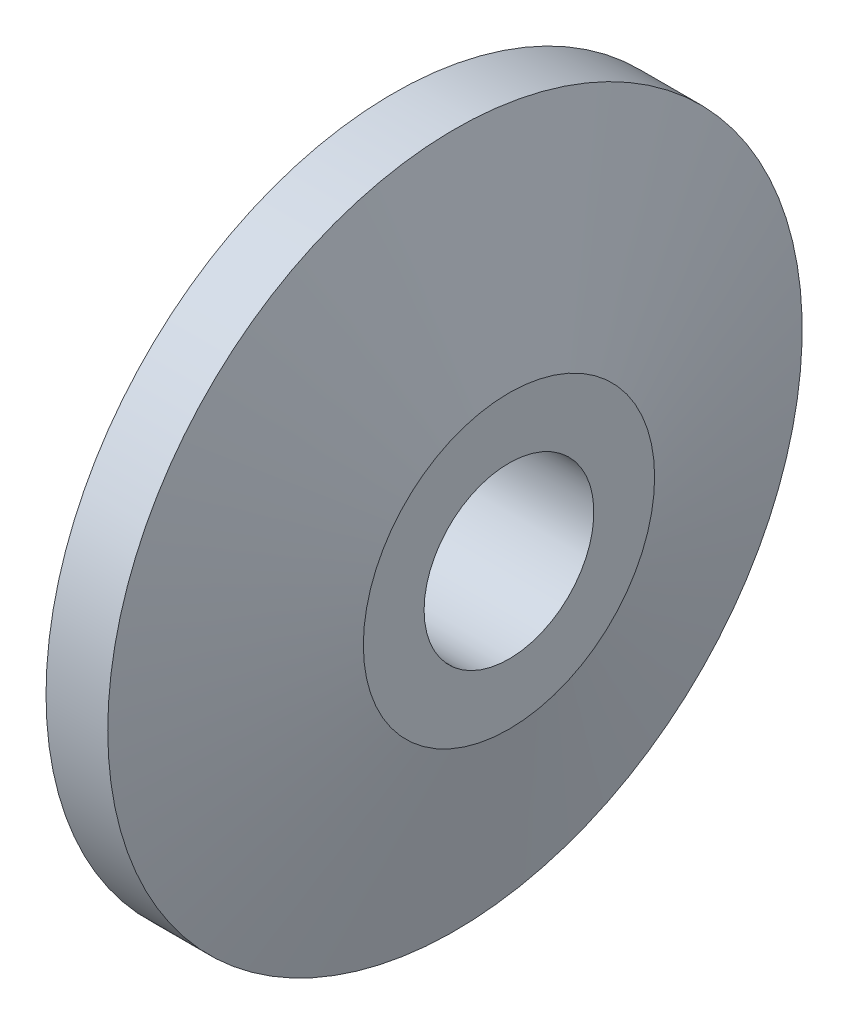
ISO-10303-21;
HEADER;
FILE_DESCRIPTION(('STEP AP214'),'2;1');
FILE_NAME('part.step','',(''),(''),'','','');
FILE_SCHEMA(('AUTOMOTIVE_DESIGN { 1 0 10303 214 1 1 1 1 }'));
ENDSEC;
DATA;
#1=APPLICATION_CONTEXT('core data for automotive mechanical design processes');
#2=APPLICATION_PROTOCOL_DEFINITION('international standard','automotive_design',2000,#1);
#3=PRODUCT_CONTEXT('',#1,'mechanical');
#4=PRODUCT('Part','Part','',(#3));
#5=PRODUCT_RELATED_PRODUCT_CATEGORY('part','',(#4));
#6=PRODUCT_DEFINITION_FORMATION('','',#4);
#7=PRODUCT_DEFINITION_CONTEXT('part definition',#1,'design');
#8=PRODUCT_DEFINITION('design','',#6,#7);
#9=PRODUCT_DEFINITION_SHAPE('','',#8);
#10=(LENGTH_UNIT() NAMED_UNIT(*) SI_UNIT(.MILLI.,.METRE.));
#11=(NAMED_UNIT(*) PLANE_ANGLE_UNIT() SI_UNIT($,.RADIAN.));
#12=(NAMED_UNIT(*) SI_UNIT($,.STERADIAN.) SOLID_ANGLE_UNIT());
#13=UNCERTAINTY_MEASURE_WITH_UNIT(LENGTH_MEASURE(1.E-05),#10,'distance_accuracy_value','');
#14=(GEOMETRIC_REPRESENTATION_CONTEXT(3) GLOBAL_UNCERTAINTY_ASSIGNED_CONTEXT((#13)) GLOBAL_UNIT_ASSIGNED_CONTEXT((#10,
#11,#12)) REPRESENTATION_CONTEXT('',''));
#15=CARTESIAN_POINT('',(0.,0.,0.));
#16=DIRECTION('',(0.,0.,1.));
#17=DIRECTION('',(1.,0.,0.));
#18=AXIS2_PLACEMENT_3D('',#15,#16,#17);
#19=CARTESIAN_POINT('',(0.,25.,0.));
#20=DIRECTION('',(1.,0.,0.));
#21=DIRECTION('',(0.,0.,-1.));
#22=AXIS2_PLACEMENT_3D('',#19,#20,#21);
#23=PLANE('',#22);
#24=CARTESIAN_POINT('',(0.,0.,0.));
#25=DIRECTION('',(-1.,0.,0.));
#26=DIRECTION('',(0.,0.,1.));
#27=AXIS2_PLACEMENT_3D('',#24,#25,#26);
#28=CIRCLE('',#27,11.);
#29=CARTESIAN_POINT('',(0.,0.,11.));
#30=VERTEX_POINT('',#29);
#31=EDGE_CURVE('E53',#30,#30,#28,.T.);
#32=ORIENTED_EDGE('',*,*,#31,.F.);
#33=EDGE_LOOP('',(#32));
#34=FACE_BOUND('',#33,.T.);
#35=CARTESIAN_POINT('',(0.,0.,0.));
#36=DIRECTION('',(-1.,0.,0.));
#37=DIRECTION('',(0.,0.,1.));
#38=AXIS2_PLACEMENT_3D('',#35,#36,#37);
#39=CIRCLE('',#38,25.);
#40=CARTESIAN_POINT('',(0.,0.,25.));
#41=VERTEX_POINT('',#40);
#42=EDGE_CURVE('E10',#41,#41,#39,.T.);
#43=ORIENTED_EDGE('',*,*,#42,.T.);
#44=EDGE_LOOP('',(#43));
#45=FACE_BOUND('',#44,.T.);
#46=ADVANCED_FACE('F28',(#34,#45),#23,.F.);
#47=CARTESIAN_POINT('',(0.,0.,0.));
#48=DIRECTION('',(-1.,0.,0.));
#49=DIRECTION('',(0.,0.,1.));
#50=AXIS2_PLACEMENT_3D('',#47,#48,#49);
#51=CYLINDRICAL_SURFACE('',#50,25.);
#52=ORIENTED_EDGE('',*,*,#42,.F.);
#53=EDGE_LOOP('',(#52));
#54=FACE_BOUND('',#53,.T.);
#55=CARTESIAN_POINT('',(13.,0.,0.));
#56=DIRECTION('',(-1.,0.,0.));
#57=DIRECTION('',(0.,0.,1.));
#58=AXIS2_PLACEMENT_3D('',#55,#56,#57);
#59=CIRCLE('',#58,25.);
#60=CARTESIAN_POINT('',(13.,0.,25.));
#61=VERTEX_POINT('',#60);
#62=EDGE_CURVE('E34',#61,#61,#59,.T.);
#63=ORIENTED_EDGE('',*,*,#62,.T.);
#64=EDGE_LOOP('',(#63));
#65=FACE_BOUND('',#64,.T.);
#66=ADVANCED_FACE('F60',(#54,#65),#51,.T.);
#67=CARTESIAN_POINT('',(13.,45.,0.));
#68=DIRECTION('',(1.,0.,0.));
#69=DIRECTION('',(0.,0.,-1.));
#70=AXIS2_PLACEMENT_3D('',#67,#68,#69);
#71=PLANE('',#70);
#72=ORIENTED_EDGE('',*,*,#62,.F.);
#73=EDGE_LOOP('',(#72));
#74=FACE_BOUND('',#73,.T.);
#75=CARTESIAN_POINT('',(13.,0.,0.));
#76=DIRECTION('',(-1.,0.,0.));
#77=DIRECTION('',(0.,0.,1.));
#78=AXIS2_PLACEMENT_3D('',#75,#76,#77);
#79=CIRCLE('',#78,45.);
#80=CARTESIAN_POINT('',(13.,0.,45.));
#81=VERTEX_POINT('',#80);
#82=EDGE_CURVE('E38',#81,#81,#79,.T.);
#83=ORIENTED_EDGE('',*,*,#82,.T.);
#84=EDGE_LOOP('',(#83));
#85=FACE_BOUND('',#84,.T.);
#86=ADVANCED_FACE('F64',(#74,#85),#71,.F.);
#87=CARTESIAN_POINT('',(0.,0.,0.));
#88=DIRECTION('',(-1.,0.,0.));
#89=DIRECTION('',(0.,0.,1.));
#90=AXIS2_PLACEMENT_3D('',#87,#88,#89);
#91=CYLINDRICAL_SURFACE('',#90,45.);
#92=ORIENTED_EDGE('',*,*,#82,.F.);
#93=EDGE_LOOP('',(#92));
#94=FACE_BOUND('',#93,.T.);
#95=CARTESIAN_POINT('',(21.,0.,0.));
#96=DIRECTION('',(-1.,0.,0.));
#97=DIRECTION('',(0.,0.,1.));
#98=AXIS2_PLACEMENT_3D('',#95,#96,#97);
#99=CIRCLE('',#98,45.);
#100=CARTESIAN_POINT('',(21.,0.,45.));
#101=VERTEX_POINT('',#100);
#102=EDGE_CURVE('E42',#101,#101,#99,.T.);
#103=ORIENTED_EDGE('',*,*,#102,.T.);
#104=EDGE_LOOP('',(#103));
#105=FACE_BOUND('',#104,.T.);
#106=ADVANCED_FACE('F69',(#94,#105),#91,.T.);
#107=CARTESIAN_POINT('',(28.,0.,0.));
#108=DIRECTION('',(-1.,0.,0.));
#109=DIRECTION('',(0.,0.,1.));
#110=AXIS2_PLACEMENT_3D('',#107,#108,#109);
#111=CONICAL_SURFACE('',#110,18.8756443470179,1.30899693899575);
#112=ORIENTED_EDGE('',*,*,#102,.F.);
#113=EDGE_LOOP('',(#112));
#114=FACE_BOUND('',#113,.T.);
#115=CARTESIAN_POINT('',(28.,0.,0.));
#116=DIRECTION('',(-1.,0.,0.));
#117=DIRECTION('',(0.,0.,1.));
#118=AXIS2_PLACEMENT_3D('',#115,#116,#117);
#119=CIRCLE('',#118,18.8756443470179);
#120=CARTESIAN_POINT('',(28.,0.,18.8756443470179));
#121=VERTEX_POINT('',#120);
#122=EDGE_CURVE('E47',#121,#121,#119,.T.);
#123=ORIENTED_EDGE('',*,*,#122,.T.);
#124=EDGE_LOOP('',(#123));
#125=FACE_BOUND('',#124,.T.);
#126=ADVANCED_FACE('F75',(#114,#125),#111,.T.);
#127=CARTESIAN_POINT('',(28.,11.,0.));
#128=DIRECTION('',(-1.,0.,0.));
#129=DIRECTION('',(0.,0.,1.));
#130=AXIS2_PLACEMENT_3D('',#127,#128,#129);
#131=PLANE('',#130);
#132=ORIENTED_EDGE('',*,*,#122,.F.);
#133=EDGE_LOOP('',(#132));
#134=FACE_BOUND('',#133,.T.);
#135=CARTESIAN_POINT('',(28.,0.,0.));
#136=DIRECTION('',(-1.,0.,0.));
#137=DIRECTION('',(0.,0.,1.));
#138=AXIS2_PLACEMENT_3D('',#135,#136,#137);
#139=CIRCLE('',#138,11.);
#140=CARTESIAN_POINT('',(28.,0.,11.));
#141=VERTEX_POINT('',#140);
#142=EDGE_CURVE('E50',#141,#141,#139,.T.);
#143=ORIENTED_EDGE('',*,*,#142,.T.);
#144=EDGE_LOOP('',(#143));
#145=FACE_BOUND('',#144,.T.);
#146=ADVANCED_FACE('F79',(#134,#145),#131,.F.);
#147=CARTESIAN_POINT('',(0.,0.,0.));
#148=DIRECTION('',(-1.,0.,0.));
#149=DIRECTION('',(0.,0.,1.));
#150=AXIS2_PLACEMENT_3D('',#147,#148,#149);
#151=CYLINDRICAL_SURFACE('',#150,11.);
#152=ORIENTED_EDGE('',*,*,#142,.F.);
#153=EDGE_LOOP('',(#152));
#154=FACE_BOUND('',#153,.T.);
#155=ORIENTED_EDGE('',*,*,#31,.T.);
#156=EDGE_LOOP('',(#155));
#157=FACE_BOUND('',#156,.T.);
#158=ADVANCED_FACE('F57',(#154,#157),#151,.F.);
#159=CLOSED_SHELL('',(#46,#66,#86,#106,#126,#146,#158));
#160=MANIFOLD_SOLID_BREP('B2',#159);
#161=ADVANCED_BREP_SHAPE_REPRESENTATION('',(#18,#160),#14);
#162=SHAPE_DEFINITION_REPRESENTATION(#9,#161);
ENDSEC;
END-ISO-10303-21;
